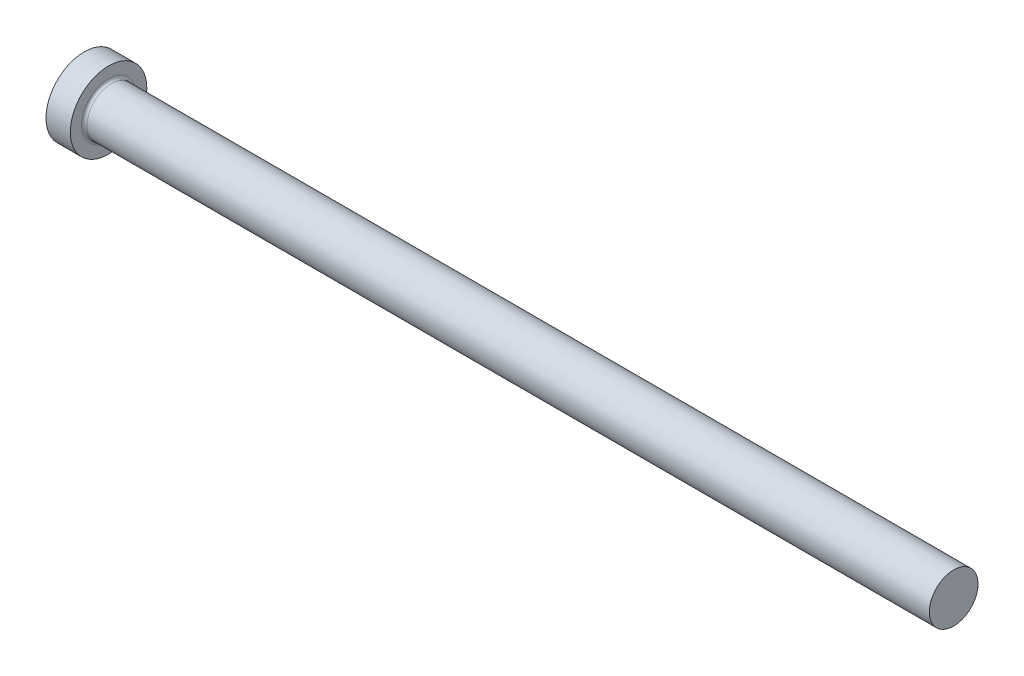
ISO-10303-21;
HEADER;
FILE_DESCRIPTION(('STEP AP214'),'2;1');
FILE_NAME('part.step','',(''),(''),'','','');
FILE_SCHEMA(('AUTOMOTIVE_DESIGN { 1 0 10303 214 1 1 1 1 }'));
ENDSEC;
DATA;
#1=APPLICATION_CONTEXT('core data for automotive mechanical design processes');
#2=APPLICATION_PROTOCOL_DEFINITION('international standard','automotive_design',2000,#1);
#3=PRODUCT_CONTEXT('',#1,'mechanical');
#4=PRODUCT('Part','Part','',(#3));
#5=PRODUCT_RELATED_PRODUCT_CATEGORY('part','',(#4));
#6=PRODUCT_DEFINITION_FORMATION('','',#4);
#7=PRODUCT_DEFINITION_CONTEXT('part definition',#1,'design');
#8=PRODUCT_DEFINITION('design','',#6,#7);
#9=PRODUCT_DEFINITION_SHAPE('','',#8);
#10=(LENGTH_UNIT() NAMED_UNIT(*) SI_UNIT(.MILLI.,.METRE.));
#11=(NAMED_UNIT(*) PLANE_ANGLE_UNIT() SI_UNIT($,.RADIAN.));
#12=(NAMED_UNIT(*) SI_UNIT($,.STERADIAN.) SOLID_ANGLE_UNIT());
#13=UNCERTAINTY_MEASURE_WITH_UNIT(LENGTH_MEASURE(1.E-05),#10,'distance_accuracy_value','');
#14=(GEOMETRIC_REPRESENTATION_CONTEXT(3) GLOBAL_UNCERTAINTY_ASSIGNED_CONTEXT((#13)) GLOBAL_UNIT_ASSIGNED_CONTEXT((#10,
#11,#12)) REPRESENTATION_CONTEXT('',''));
#15=CARTESIAN_POINT('',(0.,0.,0.));
#16=DIRECTION('',(0.,0.,1.));
#17=DIRECTION('',(1.,0.,0.));
#18=AXIS2_PLACEMENT_3D('',#15,#16,#17);
#19=CARTESIAN_POINT('',(0.,0.,0.));
#20=DIRECTION('',(-1.,0.,0.));
#21=DIRECTION('',(0.,-1.,0.));
#22=AXIS2_PLACEMENT_3D('',#19,#20,#21);
#23=PLANE('',#22);
#24=CARTESIAN_POINT('',(0.,0.,0.));
#25=DIRECTION('',(1.,0.,0.));
#26=DIRECTION('',(0.,1.,0.));
#27=AXIS2_PLACEMENT_3D('',#24,#25,#26);
#28=CIRCLE('',#27,11.);
#29=CARTESIAN_POINT('',(0.,11.,0.));
#30=VERTEX_POINT('',#29);
#31=EDGE_CURVE('E25',#30,#30,#28,.T.);
#32=ORIENTED_EDGE('',*,*,#31,.F.);
#33=EDGE_LOOP('',(#32));
#34=FACE_BOUND('',#33,.T.);
#35=ADVANCED_FACE('F14',(#34),#23,.T.);
#36=CARTESIAN_POINT('',(250.,0.,0.));
#37=DIRECTION('',(1.,0.,0.));
#38=DIRECTION('',(0.,1.,0.));
#39=AXIS2_PLACEMENT_3D('',#36,#37,#38);
#40=CYLINDRICAL_SURFACE('',#39,11.);
#41=ORIENTED_EDGE('',*,*,#31,.T.);
#42=EDGE_LOOP('',(#41));
#43=FACE_BOUND('',#42,.T.);
#44=CARTESIAN_POINT('',(7.,0.,0.));
#45=DIRECTION('',(1.,0.,0.));
#46=DIRECTION('',(0.,1.,0.));
#47=AXIS2_PLACEMENT_3D('',#44,#45,#46);
#48=CIRCLE('',#47,11.);
#49=CARTESIAN_POINT('',(7.,11.,0.));
#50=VERTEX_POINT('',#49);
#51=EDGE_CURVE('E29',#50,#50,#48,.T.);
#52=ORIENTED_EDGE('',*,*,#51,.F.);
#53=EDGE_LOOP('',(#52));
#54=FACE_BOUND('',#53,.T.);
#55=ADVANCED_FACE('F51',(#43,#54),#40,.T.);
#56=CARTESIAN_POINT('',(7.,11.,0.));
#57=DIRECTION('',(1.,0.,0.));
#58=DIRECTION('',(0.,1.,0.));
#59=AXIS2_PLACEMENT_3D('',#56,#57,#58);
#60=PLANE('',#59);
#61=CARTESIAN_POINT('',(7.,0.,0.));
#62=DIRECTION('',(1.,0.,0.));
#63=DIRECTION('',(0.,1.,0.));
#64=AXIS2_PLACEMENT_3D('',#61,#62,#63);
#65=CIRCLE('',#64,7.8);
#66=CARTESIAN_POINT('',(7.,7.8,0.));
#67=VERTEX_POINT('',#66);
#68=EDGE_CURVE('E9',#67,#67,#65,.F.);
#69=ORIENTED_EDGE('',*,*,#68,.T.);
#70=EDGE_LOOP('',(#69));
#71=FACE_BOUND('',#70,.T.);
#72=ORIENTED_EDGE('',*,*,#51,.T.);
#73=EDGE_LOOP('',(#72));
#74=FACE_BOUND('',#73,.T.);
#75=ADVANCED_FACE('F42',(#71,#74),#60,.T.);
#76=CARTESIAN_POINT('',(250.,0.,0.));
#77=DIRECTION('',(1.,0.,0.));
#78=DIRECTION('',(0.,1.,0.));
#79=AXIS2_PLACEMENT_3D('',#76,#77,#78);
#80=CYLINDRICAL_SURFACE('',#79,7.);
#81=CARTESIAN_POINT('',(7.8,0.,0.));
#82=DIRECTION('',(1.,0.,0.));
#83=DIRECTION('',(0.,1.,0.));
#84=AXIS2_PLACEMENT_3D('',#81,#82,#83);
#85=CIRCLE('',#84,7.);
#86=CARTESIAN_POINT('',(7.8,7.,0.));
#87=VERTEX_POINT('',#86);
#88=EDGE_CURVE('E21',#87,#87,#85,.T.);
#89=ORIENTED_EDGE('',*,*,#88,.T.);
#90=EDGE_LOOP('',(#89));
#91=FACE_BOUND('',#90,.T.);
#92=CARTESIAN_POINT('',(250.,0.,0.));
#93=DIRECTION('',(1.,0.,0.));
#94=DIRECTION('',(0.,1.,0.));
#95=AXIS2_PLACEMENT_3D('',#92,#93,#94);
#96=CIRCLE('',#95,7.);
#97=CARTESIAN_POINT('',(250.,7.00000000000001,0.));
#98=VERTEX_POINT('',#97);
#99=EDGE_CURVE('E34',#98,#98,#96,.T.);
#100=ORIENTED_EDGE('',*,*,#99,.F.);
#101=EDGE_LOOP('',(#100));
#102=FACE_BOUND('',#101,.T.);
#103=ADVANCED_FACE('F40',(#91,#102),#80,.T.);
#104=CARTESIAN_POINT('',(250.,7.,0.));
#105=DIRECTION('',(1.,0.,0.));
#106=DIRECTION('',(0.,1.,0.));
#107=AXIS2_PLACEMENT_3D('',#104,#105,#106);
#108=PLANE('',#107);
#109=ORIENTED_EDGE('',*,*,#99,.T.);
#110=EDGE_LOOP('',(#109));
#111=FACE_BOUND('',#110,.T.);
#112=ADVANCED_FACE('F38',(#111),#108,.T.);
#113=CARTESIAN_POINT('',(7.8,0.,0.));
#114=DIRECTION('',(1.,0.,0.));
#115=DIRECTION('',(0.,1.,0.));
#116=AXIS2_PLACEMENT_3D('',#113,#114,#115);
#117=TOROIDAL_SURFACE('',#116,7.8,0.8);
#118=ORIENTED_EDGE('',*,*,#68,.F.);
#119=EDGE_LOOP('',(#118));
#120=FACE_BOUND('',#119,.T.);
#121=ORIENTED_EDGE('',*,*,#88,.F.);
#122=EDGE_LOOP('',(#121));
#123=FACE_BOUND('',#122,.T.);
#124=ADVANCED_FACE('F16',(#120,#123),#117,.F.);
#125=CLOSED_SHELL('',(#35,#55,#75,#103,#112,#124));
#126=MANIFOLD_SOLID_BREP('B1',#125);
#127=ADVANCED_BREP_SHAPE_REPRESENTATION('',(#18,#126),#14);
#128=SHAPE_DEFINITION_REPRESENTATION(#9,#127);
ENDSEC;
END-ISO-10303-21;
